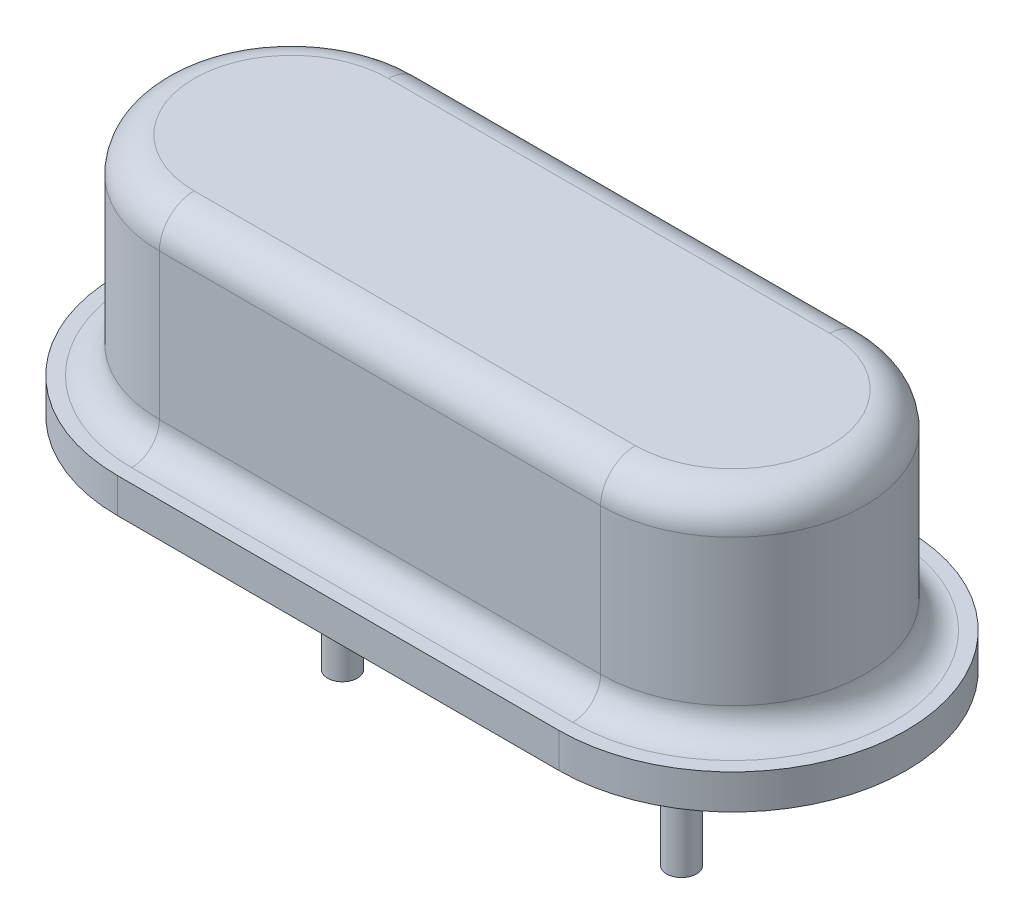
from build123d import *

# Parameters (mm, degrees)
EXTRUDE_1_DEPTH = 0.5
EXTRUDE_2_DEPTH = 3
FILLET_1_R      = 0.4
FILLET_2_R      = 0.5


with BuildPart() as part:
    # Sketch 2 → Revolve 1 (revolve)
    with BuildSketch(Plane.XY):
        with BuildLine():
            Line((0, -2.5), (0.215, -2.5))
            Line((0.215, -2.5), (0.215, 0))
            Line((0.215, 0), (0.312701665, 0))
            ThreePointArc((0.312701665, 0), (0.55765064, 0.083772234), (0.7, 0.3))
            Line((0.7, 0.3), (0, 0.3))
            Line((0, 0.3), (0, -2.5))
        make_face()
    revolve_1 = revolve(axis=Axis((0, -2.5, 0), (0, 1, 0)))

    # Sketch 3 → Extrude 1 (add)
    with BuildSketch(Plane(origin=(0, 0.3, 0), x_dir=(-1, 0, 0), z_dir=(0, 1, 0))):
        with BuildLine():
            Line((0.735, 2.5), (-5.615, 2.5))
            ThreePointArc((-5.615, 2.5), (-8.115, 0), (-5.615, -2.5))
            Line((-5.615, -2.5), (0.735, -2.5))
            ThreePointArc((0.735, -2.5), (3.235, 0), (0.735, 2.5))
        make_face()
    extrude(amount=EXTRUDE_1_DEPTH)

    # Sketch 4 → Extrude 2 (add)
    with BuildSketch(Plane(origin=(0, 0.8, 0), x_dir=(-1, 0, 0), z_dir=(0, 1, 0))):
        with BuildLine():
            Line((0.735, 1.9), (-5.615, 1.9))
            ThreePointArc((-5.615, 1.9), (-7.515, 0), (-5.615, -1.9))
            Line((-5.615, -1.9), (0.735, -1.9))
            ThreePointArc((0.735, -1.9), (2.635, 0), (0.735, 1.9))
        make_face()
    extrude(amount=EXTRUDE_2_DEPTH)

    # Mirror 1: Revolve 1 across plane
    add(revolve_1.mirror(Plane(origin=(2.44, 0, 0), x_dir=(0, 0, 1), z_dir=(1, 0, 0))))

    # Fillet 1
    fillet_1_edges = [part.edges().sort_by_distance(p)[0] for p in [
        (2.44, 0.8, -1.9),
        (7.515, 0.8, 0),
        (2.44, 0.8, 1.9),
        (-2.635, 0.8, 0),
    ]]
    fillet(fillet_1_edges, radius=FILLET_1_R)

    # Fillet 2
    fillet_2_edges = [part.edges().sort_by_distance(p)[0] for p in [
        (2.44, 3.8, -1.9),
        (7.515, 3.8, 0),
        (2.44, 3.8, 1.9),
        (-2.635, 3.8, 0),
    ]]
    fillet(fillet_2_edges, radius=FILLET_2_R)


solid = part.part
